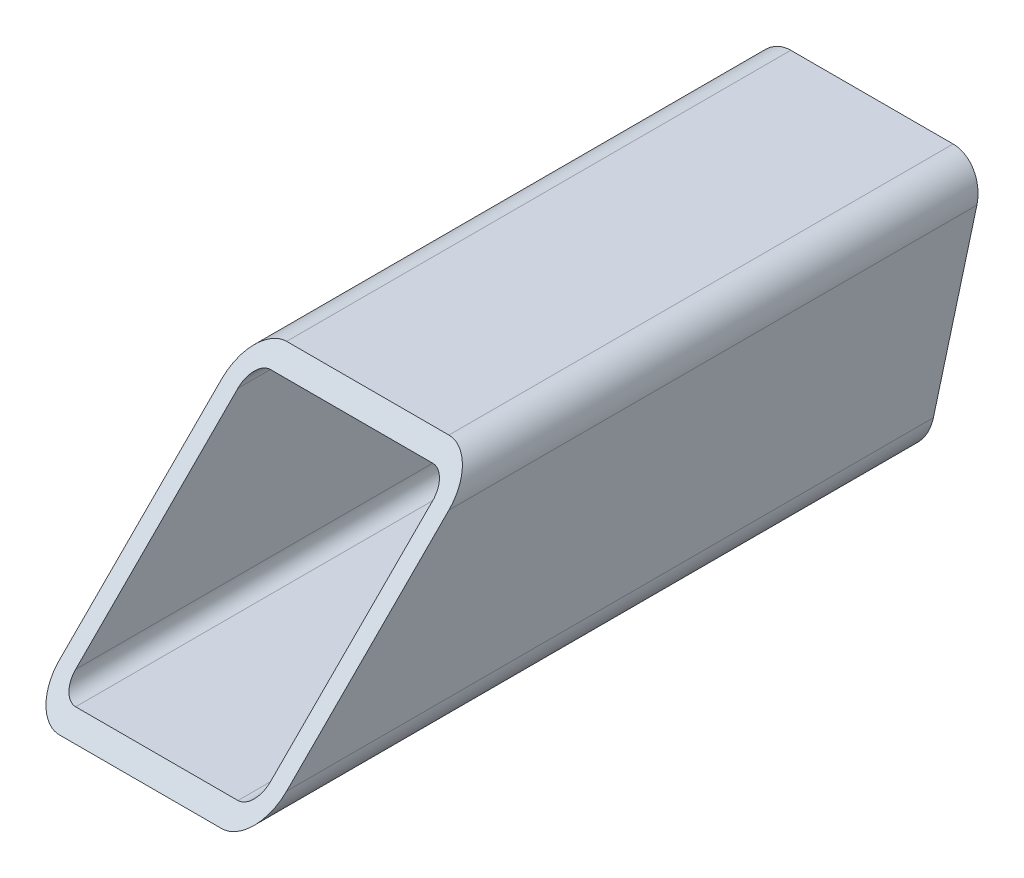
ISO-10303-21;
HEADER;
FILE_DESCRIPTION(('STEP AP214'),'2;1');
FILE_NAME('part.step','',(''),(''),'','','');
FILE_SCHEMA(('AUTOMOTIVE_DESIGN { 1 0 10303 214 1 1 1 1 }'));
ENDSEC;
DATA;
#1=APPLICATION_CONTEXT('core data for automotive mechanical design processes');
#2=APPLICATION_PROTOCOL_DEFINITION('international standard','automotive_design',2000,#1);
#3=PRODUCT_CONTEXT('',#1,'mechanical');
#4=PRODUCT('Part','Part','',(#3));
#5=PRODUCT_RELATED_PRODUCT_CATEGORY('part','',(#4));
#6=PRODUCT_DEFINITION_FORMATION('','',#4);
#7=PRODUCT_DEFINITION_CONTEXT('part definition',#1,'design');
#8=PRODUCT_DEFINITION('design','',#6,#7);
#9=PRODUCT_DEFINITION_SHAPE('','',#8);
#10=(LENGTH_UNIT() NAMED_UNIT(*) SI_UNIT(.MILLI.,.METRE.));
#11=(NAMED_UNIT(*) PLANE_ANGLE_UNIT() SI_UNIT($,.RADIAN.));
#12=(NAMED_UNIT(*) SI_UNIT($,.STERADIAN.) SOLID_ANGLE_UNIT());
#13=UNCERTAINTY_MEASURE_WITH_UNIT(LENGTH_MEASURE(1.E-05),#10,'distance_accuracy_value','');
#14=(GEOMETRIC_REPRESENTATION_CONTEXT(3) GLOBAL_UNCERTAINTY_ASSIGNED_CONTEXT((#13)) GLOBAL_UNIT_ASSIGNED_CONTEXT((#10,
#11,#12)) REPRESENTATION_CONTEXT('',''));
#15=CARTESIAN_POINT('',(0.,0.,0.));
#16=DIRECTION('',(0.,0.,1.));
#17=DIRECTION('',(1.,0.,0.));
#18=AXIS2_PLACEMENT_3D('',#15,#16,#17);
#19=CARTESIAN_POINT('',(-25.,25.,230.));
#20=DIRECTION('',(0.,0.,-1.));
#21=DIRECTION('',(-1.,0.,0.));
#22=AXIS2_PLACEMENT_3D('',#19,#20,#21);
#23=CYLINDRICAL_SURFACE('',#22,10.);
#24=DIRECTION('',(0.,0.,-1.));
#25=VECTOR('',#24,1.);
#26=CARTESIAN_POINT('',(-35.,25.,230.));
#27=LINE('',#26,#25);
#28=CARTESIAN_POINT('',(-35.,25.,165.321443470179));
#29=VERTEX_POINT('',#28);
#30=CARTESIAN_POINT('',(-35.,25.,2.67949192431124));
#31=VERTEX_POINT('',#30);
#32=EDGE_CURVE('E157',#29,#31,#27,.T.);
#33=ORIENTED_EDGE('',*,*,#32,.F.);
#34=CARTESIAN_POINT('',(-25.,25.,165.321443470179));
#35=DIRECTION('',(0.,-0.707106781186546,-0.707106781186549));
#36=DIRECTION('',(0.,0.707106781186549,-0.707106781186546));
#37=AXIS2_PLACEMENT_3D('',#34,#35,#36);
#38=ELLIPSE('',#37,14.1421356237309,10.);
#39=CARTESIAN_POINT('',(-25.,35.,155.321443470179));
#40=VERTEX_POINT('',#39);
#41=EDGE_CURVE('E141',#29,#40,#38,.T.);
#42=ORIENTED_EDGE('',*,*,#41,.T.);
#43=DIRECTION('',(0.,0.,-1.));
#44=VECTOR('',#43,1.);
#45=CARTESIAN_POINT('',(-25.,35.,230.));
#46=LINE('',#45,#44);
#47=CARTESIAN_POINT('',(-25.,35.,0.));
#48=VERTEX_POINT('',#47);
#49=EDGE_CURVE('E178',#40,#48,#46,.T.);
#50=ORIENTED_EDGE('',*,*,#49,.T.);
#51=CARTESIAN_POINT('',(-25.,25.,2.67949192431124));
#52=DIRECTION('',(0.,0.258819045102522,0.965925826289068));
#53=DIRECTION('',(0.,0.965925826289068,-0.258819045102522));
#54=AXIS2_PLACEMENT_3D('',#51,#52,#53);
#55=ELLIPSE('',#54,10.3527618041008,10.);
#56=EDGE_CURVE('E163',#48,#31,#55,.T.);
#57=ORIENTED_EDGE('',*,*,#56,.T.);
#58=EDGE_LOOP('',(#33,#42,#50,#57));
#59=FACE_BOUND('',#58,.T.);
#60=ADVANCED_FACE('F32',(#59),#23,.T.);
#61=CARTESIAN_POINT('',(-35.,25.,230.));
#62=DIRECTION('',(1.,0.,0.));
#63=DIRECTION('',(0.,1.,0.));
#64=AXIS2_PLACEMENT_3D('',#61,#62,#63);
#65=PLANE('',#64);
#66=DIRECTION('',(0.,0.,-1.));
#67=VECTOR('',#66,1.);
#68=CARTESIAN_POINT('',(-35.,-25.,230.));
#69=LINE('',#68,#67);
#70=CARTESIAN_POINT('',(-35.,-25.,215.321443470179));
#71=VERTEX_POINT('',#70);
#72=CARTESIAN_POINT('',(-35.,-25.,16.0769515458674));
#73=VERTEX_POINT('',#72);
#74=EDGE_CURVE('E159',#71,#73,#69,.T.);
#75=ORIENTED_EDGE('',*,*,#74,.F.);
#76=DIRECTION('',(0.,-0.707106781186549,0.707106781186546));
#77=VECTOR('',#76,1.);
#78=CARTESIAN_POINT('',(-35.,-35.,225.321443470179));
#79=LINE('',#78,#77);
#80=EDGE_CURVE('E144',#29,#71,#79,.T.);
#81=ORIENTED_EDGE('',*,*,#80,.F.);
#82=ORIENTED_EDGE('',*,*,#32,.T.);
#83=DIRECTION('',(0.,0.965925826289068,-0.258819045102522));
#84=VECTOR('',#83,1.);
#85=CARTESIAN_POINT('',(-35.,35.,0.));
#86=LINE('',#85,#84);
#87=EDGE_CURVE('E150',#73,#31,#86,.T.);
#88=ORIENTED_EDGE('',*,*,#87,.F.);
#89=EDGE_LOOP('',(#75,#81,#82,#88));
#90=FACE_BOUND('',#89,.T.);
#91=ADVANCED_FACE('F155',(#90),#65,.F.);
#92=CARTESIAN_POINT('',(-25.,-25.,230.));
#93=DIRECTION('',(0.,0.,-1.));
#94=DIRECTION('',(-1.,0.,0.));
#95=AXIS2_PLACEMENT_3D('',#92,#93,#94);
#96=CYLINDRICAL_SURFACE('',#95,10.);
#97=DIRECTION('',(0.,0.,-1.));
#98=VECTOR('',#97,1.);
#99=CARTESIAN_POINT('',(-25.,-35.,230.));
#100=LINE('',#99,#98);
#101=CARTESIAN_POINT('',(-25.,-35.,225.321443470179));
#102=VERTEX_POINT('',#101);
#103=CARTESIAN_POINT('',(-25.,-35.,18.7564434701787));
#104=VERTEX_POINT('',#103);
#105=EDGE_CURVE('E166',#102,#104,#100,.T.);
#106=ORIENTED_EDGE('',*,*,#105,.F.);
#107=CARTESIAN_POINT('',(-25.,-25.,215.321443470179));
#108=DIRECTION('',(0.,-0.707106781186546,-0.707106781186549));
#109=DIRECTION('',(0.,0.707106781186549,-0.707106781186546));
#110=AXIS2_PLACEMENT_3D('',#107,#108,#109);
#111=ELLIPSE('',#110,14.1421356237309,10.);
#112=EDGE_CURVE('E151',#102,#71,#111,.T.);
#113=ORIENTED_EDGE('',*,*,#112,.T.);
#114=ORIENTED_EDGE('',*,*,#74,.T.);
#115=CARTESIAN_POINT('',(-25.,-25.,16.0769515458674));
#116=DIRECTION('',(0.,0.258819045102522,0.965925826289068));
#117=DIRECTION('',(0.,0.965925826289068,-0.258819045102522));
#118=AXIS2_PLACEMENT_3D('',#115,#116,#117);
#119=ELLIPSE('',#118,10.3527618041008,10.);
#120=EDGE_CURVE('E200',#73,#104,#119,.T.);
#121=ORIENTED_EDGE('',*,*,#120,.T.);
#122=EDGE_LOOP('',(#106,#113,#114,#121));
#123=FACE_BOUND('',#122,.T.);
#124=ADVANCED_FACE('F267',(#123),#96,.T.);
#125=CARTESIAN_POINT('',(-25.,-35.,230.));
#126=DIRECTION('',(0.,1.,0.));
#127=DIRECTION('',(0.,0.,1.));
#128=AXIS2_PLACEMENT_3D('',#125,#126,#127);
#129=PLANE('',#128);
#130=DIRECTION('',(0.,0.,-1.));
#131=VECTOR('',#130,1.);
#132=CARTESIAN_POINT('',(25.,-35.,230.));
#133=LINE('',#132,#131);
#134=CARTESIAN_POINT('',(25.,-35.,225.321443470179));
#135=VERTEX_POINT('',#134);
#136=CARTESIAN_POINT('',(25.,-35.,18.7564434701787));
#137=VERTEX_POINT('',#136);
#138=EDGE_CURVE('E170',#135,#137,#133,.T.);
#139=ORIENTED_EDGE('',*,*,#138,.F.);
#140=DIRECTION('',(-1.,0.,0.));
#141=VECTOR('',#140,1.);
#142=CARTESIAN_POINT('',(215.,-35.0000000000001,225.321443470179));
#143=LINE('',#142,#141);
#144=EDGE_CURVE('E258',#135,#102,#143,.T.);
#145=ORIENTED_EDGE('',*,*,#144,.T.);
#146=ORIENTED_EDGE('',*,*,#105,.T.);
#147=DIRECTION('',(-1.,0.,0.));
#148=VECTOR('',#147,1.);
#149=CARTESIAN_POINT('',(215.,-35.0000000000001,18.7564434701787));
#150=LINE('',#149,#148);
#151=EDGE_CURVE('E233',#137,#104,#150,.T.);
#152=ORIENTED_EDGE('',*,*,#151,.F.);
#153=EDGE_LOOP('',(#139,#145,#146,#152));
#154=FACE_BOUND('',#153,.T.);
#155=ADVANCED_FACE('F264',(#154),#129,.F.);
#156=CARTESIAN_POINT('',(25.,-25.,230.));
#157=DIRECTION('',(0.,0.,-1.));
#158=DIRECTION('',(-1.,0.,0.));
#159=AXIS2_PLACEMENT_3D('',#156,#157,#158);
#160=CYLINDRICAL_SURFACE('',#159,10.);
#161=DIRECTION('',(0.,0.,-1.));
#162=VECTOR('',#161,1.);
#163=CARTESIAN_POINT('',(35.,-25.,230.));
#164=LINE('',#163,#162);
#165=CARTESIAN_POINT('',(35.,-25.,215.321443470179));
#166=VERTEX_POINT('',#165);
#167=CARTESIAN_POINT('',(35.,-25.,16.0769515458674));
#168=VERTEX_POINT('',#167);
#169=EDGE_CURVE('E172',#166,#168,#164,.T.);
#170=ORIENTED_EDGE('',*,*,#169,.F.);
#171=CARTESIAN_POINT('',(25.,-25.,215.321443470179));
#172=DIRECTION('',(0.,-0.707106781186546,-0.707106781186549));
#173=DIRECTION('',(0.,0.707106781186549,-0.707106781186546));
#174=AXIS2_PLACEMENT_3D('',#171,#172,#173);
#175=ELLIPSE('',#174,14.1421356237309,10.);
#176=EDGE_CURVE('E238',#166,#135,#175,.T.);
#177=ORIENTED_EDGE('',*,*,#176,.T.);
#178=ORIENTED_EDGE('',*,*,#138,.T.);
#179=CARTESIAN_POINT('',(25.,-25.,16.0769515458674));
#180=DIRECTION('',(0.,0.258819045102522,0.965925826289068));
#181=DIRECTION('',(0.,0.965925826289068,-0.258819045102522));
#182=AXIS2_PLACEMENT_3D('',#179,#180,#181);
#183=ELLIPSE('',#182,10.3527618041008,10.);
#184=EDGE_CURVE('E203',#137,#168,#183,.T.);
#185=ORIENTED_EDGE('',*,*,#184,.T.);
#186=EDGE_LOOP('',(#170,#177,#178,#185));
#187=FACE_BOUND('',#186,.T.);
#188=ADVANCED_FACE('F277',(#187),#160,.T.);
#189=CARTESIAN_POINT('',(35.,25.,230.));
#190=DIRECTION('',(-1.,0.,0.));
#191=DIRECTION('',(0.,0.,1.));
#192=AXIS2_PLACEMENT_3D('',#189,#190,#191);
#193=PLANE('',#192);
#194=DIRECTION('',(0.,0.,-1.));
#195=VECTOR('',#194,1.);
#196=CARTESIAN_POINT('',(35.,25.,230.));
#197=LINE('',#196,#195);
#198=CARTESIAN_POINT('',(35.,25.,165.321443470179));
#199=VERTEX_POINT('',#198);
#200=CARTESIAN_POINT('',(35.,25.,2.67949192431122));
#201=VERTEX_POINT('',#200);
#202=EDGE_CURVE('E174',#199,#201,#197,.T.);
#203=ORIENTED_EDGE('',*,*,#202,.F.);
#204=DIRECTION('',(0.,-0.707106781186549,0.707106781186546));
#205=VECTOR('',#204,1.);
#206=CARTESIAN_POINT('',(35.,-7.33927826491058,197.660721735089));
#207=LINE('',#206,#205);
#208=EDGE_CURVE('E241',#199,#166,#207,.T.);
#209=ORIENTED_EDGE('',*,*,#208,.T.);
#210=ORIENTED_EDGE('',*,*,#169,.T.);
#211=DIRECTION('',(0.,0.965925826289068,-0.258819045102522));
#212=VECTOR('',#211,1.);
#213=CARTESIAN_POINT('',(35.,-31.8301270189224,17.9070785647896));
#214=LINE('',#213,#212);
#215=EDGE_CURVE('E206',#168,#201,#214,.T.);
#216=ORIENTED_EDGE('',*,*,#215,.T.);
#217=EDGE_LOOP('',(#203,#209,#210,#216));
#218=FACE_BOUND('',#217,.T.);
#219=ADVANCED_FACE('F280',(#218),#193,.F.);
#220=CARTESIAN_POINT('',(25.,25.,230.));
#221=DIRECTION('',(0.,0.,-1.));
#222=DIRECTION('',(-1.,0.,0.));
#223=AXIS2_PLACEMENT_3D('',#220,#221,#222);
#224=CYLINDRICAL_SURFACE('',#223,10.);
#225=DIRECTION('',(0.,0.,-1.));
#226=VECTOR('',#225,1.);
#227=CARTESIAN_POINT('',(25.,35.,230.));
#228=LINE('',#227,#226);
#229=CARTESIAN_POINT('',(25.,35.,155.321443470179));
#230=VERTEX_POINT('',#229);
#231=CARTESIAN_POINT('',(25.,35.,0.));
#232=VERTEX_POINT('',#231);
#233=EDGE_CURVE('E176',#230,#232,#228,.T.);
#234=ORIENTED_EDGE('',*,*,#233,.F.);
#235=CARTESIAN_POINT('',(25.,25.,165.321443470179));
#236=DIRECTION('',(0.,-0.707106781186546,-0.707106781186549));
#237=DIRECTION('',(0.,0.707106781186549,-0.707106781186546));
#238=AXIS2_PLACEMENT_3D('',#235,#236,#237);
#239=ELLIPSE('',#238,14.1421356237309,10.);
#240=EDGE_CURVE('E46',#230,#199,#239,.T.);
#241=ORIENTED_EDGE('',*,*,#240,.T.);
#242=ORIENTED_EDGE('',*,*,#202,.T.);
#243=CARTESIAN_POINT('',(25.,25.,2.67949192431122));
#244=DIRECTION('',(0.,0.258819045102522,0.965925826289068));
#245=DIRECTION('',(0.,0.965925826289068,-0.258819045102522));
#246=AXIS2_PLACEMENT_3D('',#243,#244,#245);
#247=ELLIPSE('',#246,10.3527618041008,10.);
#248=EDGE_CURVE('E209',#201,#232,#247,.T.);
#249=ORIENTED_EDGE('',*,*,#248,.T.);
#250=EDGE_LOOP('',(#234,#241,#242,#249));
#251=FACE_BOUND('',#250,.T.);
#252=ADVANCED_FACE('F283',(#251),#224,.T.);
#253=CARTESIAN_POINT('',(-25.,35.,230.));
#254=DIRECTION('',(0.,-1.,0.));
#255=DIRECTION('',(1.,0.,0.));
#256=AXIS2_PLACEMENT_3D('',#253,#254,#255);
#257=PLANE('',#256);
#258=ORIENTED_EDGE('',*,*,#49,.F.);
#259=DIRECTION('',(-1.,0.,0.));
#260=VECTOR('',#259,1.);
#261=CARTESIAN_POINT('',(215.,34.9999999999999,155.321443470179));
#262=LINE('',#261,#260);
#263=EDGE_CURVE('E146',#230,#40,#262,.T.);
#264=ORIENTED_EDGE('',*,*,#263,.F.);
#265=ORIENTED_EDGE('',*,*,#233,.T.);
#266=DIRECTION('',(-1.,0.,0.));
#267=VECTOR('',#266,1.);
#268=CARTESIAN_POINT('',(-25.,35.,0.));
#269=LINE('',#268,#267);
#270=EDGE_CURVE('E180',#232,#48,#269,.T.);
#271=ORIENTED_EDGE('',*,*,#270,.T.);
#272=EDGE_LOOP('',(#258,#264,#265,#271));
#273=FACE_BOUND('',#272,.T.);
#274=ADVANCED_FACE('F285',(#273),#257,.F.);
#275=CARTESIAN_POINT('',(-25.,25.,230.));
#276=DIRECTION('',(0.,0.,-1.));
#277=DIRECTION('',(-1.,0.,0.));
#278=AXIS2_PLACEMENT_3D('',#275,#276,#277);
#279=CYLINDRICAL_SURFACE('',#278,5.);
#280=CARTESIAN_POINT('',(-25.,25.,165.321443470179));
#281=DIRECTION('',(0.,-0.707106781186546,-0.707106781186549));
#282=DIRECTION('',(0.,0.707106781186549,-0.707106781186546));
#283=AXIS2_PLACEMENT_3D('',#280,#281,#282);
#284=ELLIPSE('',#283,7.07106781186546,5.);
#285=CARTESIAN_POINT('',(-30.,25.,165.321443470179));
#286=VERTEX_POINT('',#285);
#287=CARTESIAN_POINT('',(-25.,30.,160.321443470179));
#288=VERTEX_POINT('',#287);
#289=EDGE_CURVE('E53',#286,#288,#284,.T.);
#290=ORIENTED_EDGE('',*,*,#289,.F.);
#291=DIRECTION('',(0.,0.,-1.));
#292=VECTOR('',#291,1.);
#293=CARTESIAN_POINT('',(-30.,25.,230.));
#294=LINE('',#293,#292);
#295=CARTESIAN_POINT('',(-30.,25.,2.67949192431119));
#296=VERTEX_POINT('',#295);
#297=EDGE_CURVE('E183',#286,#296,#294,.T.);
#298=ORIENTED_EDGE('',*,*,#297,.T.);
#299=CARTESIAN_POINT('',(-25.,25.,2.67949192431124));
#300=DIRECTION('',(0.,0.258819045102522,0.965925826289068));
#301=DIRECTION('',(0.,0.965925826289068,-0.258819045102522));
#302=AXIS2_PLACEMENT_3D('',#299,#300,#301);
#303=ELLIPSE('',#302,5.17638090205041,5.);
#304=CARTESIAN_POINT('',(-25.,30.,1.33974596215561));
#305=VERTEX_POINT('',#304);
#306=EDGE_CURVE('E212',#305,#296,#303,.T.);
#307=ORIENTED_EDGE('',*,*,#306,.F.);
#308=DIRECTION('',(0.,0.,-1.));
#309=VECTOR('',#308,1.);
#310=CARTESIAN_POINT('',(-25.,30.,230.));
#311=LINE('',#310,#309);
#312=EDGE_CURVE('E197',#288,#305,#311,.T.);
#313=ORIENTED_EDGE('',*,*,#312,.F.);
#314=EDGE_LOOP('',(#290,#298,#307,#313));
#315=FACE_BOUND('',#314,.T.);
#316=ADVANCED_FACE('F287',(#315),#279,.F.);
#317=CARTESIAN_POINT('',(-30.,25.,230.));
#318=DIRECTION('',(1.,0.,0.));
#319=DIRECTION('',(0.,1.,0.));
#320=AXIS2_PLACEMENT_3D('',#317,#318,#319);
#321=PLANE('',#320);
#322=DIRECTION('',(0.,0.707106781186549,-0.707106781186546));
#323=VECTOR('',#322,1.);
#324=CARTESIAN_POINT('',(-30.,-7.33927826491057,197.660721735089));
#325=LINE('',#324,#323);
#326=CARTESIAN_POINT('',(-30.,-25.,215.321443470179));
#327=VERTEX_POINT('',#326);
#328=EDGE_CURVE('E246',#327,#286,#325,.T.);
#329=ORIENTED_EDGE('',*,*,#328,.F.);
#330=DIRECTION('',(0.,0.,-1.));
#331=VECTOR('',#330,1.);
#332=CARTESIAN_POINT('',(-30.,-25.,230.));
#333=LINE('',#332,#331);
#334=CARTESIAN_POINT('',(-30.,-25.,16.0769515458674));
#335=VERTEX_POINT('',#334);
#336=EDGE_CURVE('E185',#327,#335,#333,.T.);
#337=ORIENTED_EDGE('',*,*,#336,.T.);
#338=DIRECTION('',(0.,-0.965925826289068,0.258819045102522));
#339=VECTOR('',#338,1.);
#340=CARTESIAN_POINT('',(-30.,-31.8301270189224,17.9070785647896));
#341=LINE('',#340,#339);
#342=EDGE_CURVE('E215',#296,#335,#341,.T.);
#343=ORIENTED_EDGE('',*,*,#342,.F.);
#344=ORIENTED_EDGE('',*,*,#297,.F.);
#345=EDGE_LOOP('',(#329,#337,#343,#344));
#346=FACE_BOUND('',#345,.T.);
#347=ADVANCED_FACE('F293',(#346),#321,.T.);
#348=CARTESIAN_POINT('',(-25.,-25.,230.));
#349=DIRECTION('',(0.,0.,-1.));
#350=DIRECTION('',(-1.,0.,0.));
#351=AXIS2_PLACEMENT_3D('',#348,#349,#350);
#352=CYLINDRICAL_SURFACE('',#351,5.);
#353=CARTESIAN_POINT('',(-25.,-25.,215.321443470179));
#354=DIRECTION('',(0.,-0.707106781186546,-0.707106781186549));
#355=DIRECTION('',(0.,0.707106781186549,-0.707106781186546));
#356=AXIS2_PLACEMENT_3D('',#353,#354,#355);
#357=ELLIPSE('',#356,7.07106781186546,5.);
#358=CARTESIAN_POINT('',(-25.,-30.,220.321443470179));
#359=VERTEX_POINT('',#358);
#360=EDGE_CURVE('E248',#359,#327,#357,.T.);
#361=ORIENTED_EDGE('',*,*,#360,.F.);
#362=DIRECTION('',(0.,0.,-1.));
#363=VECTOR('',#362,1.);
#364=CARTESIAN_POINT('',(-25.,-30.,230.));
#365=LINE('',#364,#363);
#366=CARTESIAN_POINT('',(-25.,-30.,17.416697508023));
#367=VERTEX_POINT('',#366);
#368=EDGE_CURVE('E187',#359,#367,#365,.T.);
#369=ORIENTED_EDGE('',*,*,#368,.T.);
#370=CARTESIAN_POINT('',(-25.,-25.,16.0769515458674));
#371=DIRECTION('',(0.,0.258819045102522,0.965925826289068));
#372=DIRECTION('',(0.,0.965925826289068,-0.258819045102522));
#373=AXIS2_PLACEMENT_3D('',#370,#371,#372);
#374=ELLIPSE('',#373,5.17638090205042,5.);
#375=EDGE_CURVE('E218',#335,#367,#374,.T.);
#376=ORIENTED_EDGE('',*,*,#375,.F.);
#377=ORIENTED_EDGE('',*,*,#336,.F.);
#378=EDGE_LOOP('',(#361,#369,#376,#377));
#379=FACE_BOUND('',#378,.T.);
#380=ADVANCED_FACE('F338',(#379),#352,.F.);
#381=CARTESIAN_POINT('',(-25.,-30.,230.));
#382=DIRECTION('',(0.,1.,0.));
#383=DIRECTION('',(-1.,0.,0.));
#384=AXIS2_PLACEMENT_3D('',#381,#382,#383);
#385=PLANE('',#384);
#386=DIRECTION('',(-1.,0.,0.));
#387=VECTOR('',#386,1.);
#388=CARTESIAN_POINT('',(-25.,-30.,220.321443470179));
#389=LINE('',#388,#387);
#390=CARTESIAN_POINT('',(25.,-30.,220.321443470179));
#391=VERTEX_POINT('',#390);
#392=EDGE_CURVE('E250',#391,#359,#389,.T.);
#393=ORIENTED_EDGE('',*,*,#392,.F.);
#394=DIRECTION('',(0.,0.,-1.));
#395=VECTOR('',#394,1.);
#396=CARTESIAN_POINT('',(25.,-30.,230.));
#397=LINE('',#396,#395);
#398=CARTESIAN_POINT('',(25.,-30.,17.416697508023));
#399=VERTEX_POINT('',#398);
#400=EDGE_CURVE('E189',#391,#399,#397,.T.);
#401=ORIENTED_EDGE('',*,*,#400,.T.);
#402=DIRECTION('',(1.,0.,0.));
#403=VECTOR('',#402,1.);
#404=CARTESIAN_POINT('',(-25.,-30.,17.416697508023));
#405=LINE('',#404,#403);
#406=EDGE_CURVE('E221',#367,#399,#405,.T.);
#407=ORIENTED_EDGE('',*,*,#406,.F.);
#408=ORIENTED_EDGE('',*,*,#368,.F.);
#409=EDGE_LOOP('',(#393,#401,#407,#408));
#410=FACE_BOUND('',#409,.T.);
#411=ADVANCED_FACE('F348',(#410),#385,.T.);
#412=CARTESIAN_POINT('',(25.,-25.,230.));
#413=DIRECTION('',(0.,0.,-1.));
#414=DIRECTION('',(-1.,0.,0.));
#415=AXIS2_PLACEMENT_3D('',#412,#413,#414);
#416=CYLINDRICAL_SURFACE('',#415,5.);
#417=CARTESIAN_POINT('',(25.,-25.,215.321443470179));
#418=DIRECTION('',(0.,-0.707106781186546,-0.707106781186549));
#419=DIRECTION('',(0.,0.707106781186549,-0.707106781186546));
#420=AXIS2_PLACEMENT_3D('',#417,#418,#419);
#421=ELLIPSE('',#420,7.07106781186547,5.);
#422=CARTESIAN_POINT('',(30.,-25.,215.321443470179));
#423=VERTEX_POINT('',#422);
#424=EDGE_CURVE('E252',#423,#391,#421,.T.);
#425=ORIENTED_EDGE('',*,*,#424,.F.);
#426=DIRECTION('',(0.,0.,-1.));
#427=VECTOR('',#426,1.);
#428=CARTESIAN_POINT('',(30.,-25.,230.));
#429=LINE('',#428,#427);
#430=CARTESIAN_POINT('',(30.,-25.,16.0769515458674));
#431=VERTEX_POINT('',#430);
#432=EDGE_CURVE('E191',#423,#431,#429,.T.);
#433=ORIENTED_EDGE('',*,*,#432,.T.);
#434=CARTESIAN_POINT('',(25.,-25.,16.0769515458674));
#435=DIRECTION('',(0.,0.258819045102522,0.965925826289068));
#436=DIRECTION('',(0.,0.965925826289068,-0.258819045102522));
#437=AXIS2_PLACEMENT_3D('',#434,#435,#436);
#438=ELLIPSE('',#437,5.17638090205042,5.);
#439=EDGE_CURVE('E224',#399,#431,#438,.T.);
#440=ORIENTED_EDGE('',*,*,#439,.F.);
#441=ORIENTED_EDGE('',*,*,#400,.F.);
#442=EDGE_LOOP('',(#425,#433,#440,#441));
#443=FACE_BOUND('',#442,.T.);
#444=ADVANCED_FACE('F358',(#443),#416,.F.);
#445=CARTESIAN_POINT('',(30.,25.,230.));
#446=DIRECTION('',(-1.,0.,0.));
#447=DIRECTION('',(0.,-1.,0.));
#448=AXIS2_PLACEMENT_3D('',#445,#446,#447);
#449=PLANE('',#448);
#450=DIRECTION('',(0.,-0.707106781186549,0.707106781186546));
#451=VECTOR('',#450,1.);
#452=CARTESIAN_POINT('',(30.,-7.33927826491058,197.660721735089));
#453=LINE('',#452,#451);
#454=CARTESIAN_POINT('',(30.,25.,165.321443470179));
#455=VERTEX_POINT('',#454);
#456=EDGE_CURVE('E254',#455,#423,#453,.T.);
#457=ORIENTED_EDGE('',*,*,#456,.F.);
#458=DIRECTION('',(0.,0.,-1.));
#459=VECTOR('',#458,1.);
#460=CARTESIAN_POINT('',(30.,25.,230.));
#461=LINE('',#460,#459);
#462=CARTESIAN_POINT('',(30.,25.,2.67949192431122));
#463=VERTEX_POINT('',#462);
#464=EDGE_CURVE('E193',#455,#463,#461,.T.);
#465=ORIENTED_EDGE('',*,*,#464,.T.);
#466=DIRECTION('',(0.,0.965925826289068,-0.258819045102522));
#467=VECTOR('',#466,1.);
#468=CARTESIAN_POINT('',(30.,-31.8301270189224,17.9070785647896));
#469=LINE('',#468,#467);
#470=EDGE_CURVE('E227',#431,#463,#469,.T.);
#471=ORIENTED_EDGE('',*,*,#470,.F.);
#472=ORIENTED_EDGE('',*,*,#432,.F.);
#473=EDGE_LOOP('',(#457,#465,#471,#472));
#474=FACE_BOUND('',#473,.T.);
#475=ADVANCED_FACE('F368',(#474),#449,.T.);
#476=CARTESIAN_POINT('',(25.,25.,230.));
#477=DIRECTION('',(0.,0.,-1.));
#478=DIRECTION('',(-1.,0.,0.));
#479=AXIS2_PLACEMENT_3D('',#476,#477,#478);
#480=CYLINDRICAL_SURFACE('',#479,5.);
#481=CARTESIAN_POINT('',(25.,25.,165.321443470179));
#482=DIRECTION('',(0.,-0.707106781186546,-0.707106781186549));
#483=DIRECTION('',(0.,0.707106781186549,-0.707106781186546));
#484=AXIS2_PLACEMENT_3D('',#481,#482,#483);
#485=ELLIPSE('',#484,7.07106781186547,5.);
#486=CARTESIAN_POINT('',(25.,30.,160.321443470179));
#487=VERTEX_POINT('',#486);
#488=EDGE_CURVE('E256',#487,#455,#485,.T.);
#489=ORIENTED_EDGE('',*,*,#488,.F.);
#490=DIRECTION('',(0.,0.,-1.));
#491=VECTOR('',#490,1.);
#492=CARTESIAN_POINT('',(25.,30.,230.));
#493=LINE('',#492,#491);
#494=CARTESIAN_POINT('',(25.,30.,1.33974596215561));
#495=VERTEX_POINT('',#494);
#496=EDGE_CURVE('E195',#487,#495,#493,.T.);
#497=ORIENTED_EDGE('',*,*,#496,.T.);
#498=CARTESIAN_POINT('',(25.,25.,2.67949192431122));
#499=DIRECTION('',(0.,0.258819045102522,0.965925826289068));
#500=DIRECTION('',(0.,0.965925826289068,-0.258819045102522));
#501=AXIS2_PLACEMENT_3D('',#498,#499,#500);
#502=ELLIPSE('',#501,5.17638090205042,5.);
#503=EDGE_CURVE('E230',#463,#495,#502,.T.);
#504=ORIENTED_EDGE('',*,*,#503,.F.);
#505=ORIENTED_EDGE('',*,*,#464,.F.);
#506=EDGE_LOOP('',(#489,#497,#504,#505));
#507=FACE_BOUND('',#506,.T.);
#508=ADVANCED_FACE('F378',(#507),#480,.F.);
#509=CARTESIAN_POINT('',(-25.,30.,230.));
#510=DIRECTION('',(0.,-1.,0.));
#511=DIRECTION('',(0.,0.,-1.));
#512=AXIS2_PLACEMENT_3D('',#509,#510,#511);
#513=PLANE('',#512);
#514=DIRECTION('',(1.,0.,0.));
#515=VECTOR('',#514,1.);
#516=CARTESIAN_POINT('',(-25.,30.,160.321443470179));
#517=LINE('',#516,#515);
#518=EDGE_CURVE('E11',#288,#487,#517,.T.);
#519=ORIENTED_EDGE('',*,*,#518,.F.);
#520=ORIENTED_EDGE('',*,*,#312,.T.);
#521=DIRECTION('',(-1.,0.,0.));
#522=VECTOR('',#521,1.);
#523=CARTESIAN_POINT('',(-25.,30.,1.33974596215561));
#524=LINE('',#523,#522);
#525=EDGE_CURVE('E39',#495,#305,#524,.T.);
#526=ORIENTED_EDGE('',*,*,#525,.F.);
#527=ORIENTED_EDGE('',*,*,#496,.F.);
#528=EDGE_LOOP('',(#519,#520,#526,#527));
#529=FACE_BOUND('',#528,.T.);
#530=ADVANCED_FACE('F388',(#529),#513,.T.);
#531=CARTESIAN_POINT('',(215.,34.9999999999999,0.));
#532=DIRECTION('',(0.,0.258819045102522,0.965925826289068));
#533=DIRECTION('',(0.,-0.965925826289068,0.258819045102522));
#534=AXIS2_PLACEMENT_3D('',#531,#532,#533);
#535=PLANE('',#534);
#536=ORIENTED_EDGE('',*,*,#306,.T.);
#537=ORIENTED_EDGE('',*,*,#342,.T.);
#538=ORIENTED_EDGE('',*,*,#375,.T.);
#539=ORIENTED_EDGE('',*,*,#406,.T.);
#540=ORIENTED_EDGE('',*,*,#439,.T.);
#541=ORIENTED_EDGE('',*,*,#470,.T.);
#542=ORIENTED_EDGE('',*,*,#503,.T.);
#543=ORIENTED_EDGE('',*,*,#525,.T.);
#544=EDGE_LOOP('',(#536,#537,#538,#539,#540,#541,#542,#543));
#545=FACE_BOUND('',#544,.T.);
#546=ORIENTED_EDGE('',*,*,#270,.F.);
#547=ORIENTED_EDGE('',*,*,#248,.F.);
#548=ORIENTED_EDGE('',*,*,#215,.F.);
#549=ORIENTED_EDGE('',*,*,#184,.F.);
#550=ORIENTED_EDGE('',*,*,#151,.T.);
#551=ORIENTED_EDGE('',*,*,#120,.F.);
#552=ORIENTED_EDGE('',*,*,#87,.T.);
#553=ORIENTED_EDGE('',*,*,#56,.F.);
#554=EDGE_LOOP('',(#546,#547,#548,#549,#550,#551,#552,#553));
#555=FACE_BOUND('',#554,.T.);
#556=ADVANCED_FACE('F271',(#545,#555),#535,.F.);
#557=CARTESIAN_POINT('',(215.,-35.0000000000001,225.321443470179));
#558=DIRECTION('',(0.,-0.707106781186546,-0.707106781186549));
#559=DIRECTION('',(0.,0.707106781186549,-0.707106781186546));
#560=AXIS2_PLACEMENT_3D('',#557,#558,#559);
#561=PLANE('',#560);
#562=ORIENTED_EDGE('',*,*,#289,.T.);
#563=ORIENTED_EDGE('',*,*,#518,.T.);
#564=ORIENTED_EDGE('',*,*,#488,.T.);
#565=ORIENTED_EDGE('',*,*,#456,.T.);
#566=ORIENTED_EDGE('',*,*,#424,.T.);
#567=ORIENTED_EDGE('',*,*,#392,.T.);
#568=ORIENTED_EDGE('',*,*,#360,.T.);
#569=ORIENTED_EDGE('',*,*,#328,.T.);
#570=EDGE_LOOP('',(#562,#563,#564,#565,#566,#567,#568,#569));
#571=FACE_BOUND('',#570,.T.);
#572=ORIENTED_EDGE('',*,*,#80,.T.);
#573=ORIENTED_EDGE('',*,*,#112,.F.);
#574=ORIENTED_EDGE('',*,*,#144,.F.);
#575=ORIENTED_EDGE('',*,*,#176,.F.);
#576=ORIENTED_EDGE('',*,*,#208,.F.);
#577=ORIENTED_EDGE('',*,*,#240,.F.);
#578=ORIENTED_EDGE('',*,*,#263,.T.);
#579=ORIENTED_EDGE('',*,*,#41,.F.);
#580=EDGE_LOOP('',(#572,#573,#574,#575,#576,#577,#578,#579));
#581=FACE_BOUND('',#580,.T.);
#582=ADVANCED_FACE('F143',(#571,#581),#561,.F.);
#583=CLOSED_SHELL('',(#60,#91,#124,#155,#188,#219,#252,#274,#316,#347,#380,#411,#444,#475,#508,
#530,#556,#582));
#584=MANIFOLD_SOLID_BREP('B2',#583);
#585=ADVANCED_BREP_SHAPE_REPRESENTATION('',(#18,#584),#14);
#586=SHAPE_DEFINITION_REPRESENTATION(#9,#585);
ENDSEC;
END-ISO-10303-21;
